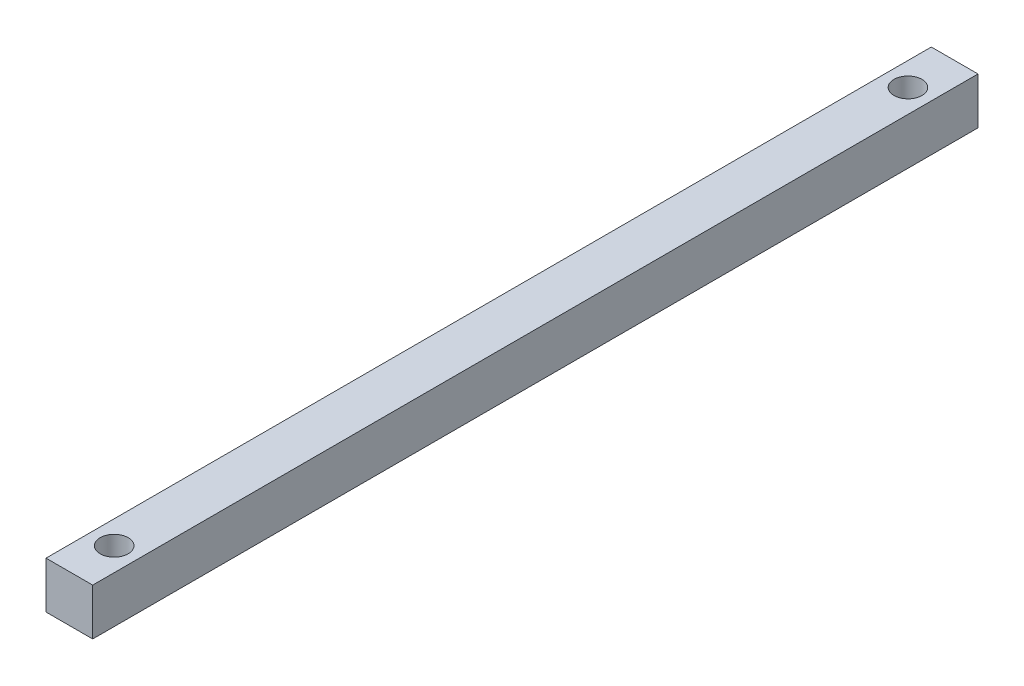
from build123d import *

# Parameters (mm, degrees)
SCHIZZO1_W               = 50
SCHIZZO1_H               = 50
ESTRUSIONE1_DEPTH        = 948
SCHIZZO8_R               = 15
TAGLIO_ESTRUSIONE2_DEPTH = 951.633473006


with BuildPart() as part:
    # Schizzo1 → Estrusione1 (new body)
    with BuildSketch(Plane.XY):
        with Locations((25, -25)):
            Rectangle(SCHIZZO1_W, SCHIZZO1_H)
    extrude(amount=ESTRUSIONE1_DEPTH)

    # Schizzo8 → Taglio-Estrusione2 (cut, through all)
    with BuildSketch(Plane.XZ.offset(50)):
        with Locations(Location((25, 900, 0), (0, 0, 270))):
            Circle(SCHIZZO8_R)
        with Locations(Location((25, 50, 0), (0, 0, 270))):
            Circle(SCHIZZO8_R)
    extrude(amount=-TAGLIO_ESTRUSIONE2_DEPTH, mode=Mode.SUBTRACT)


solid = part.part
